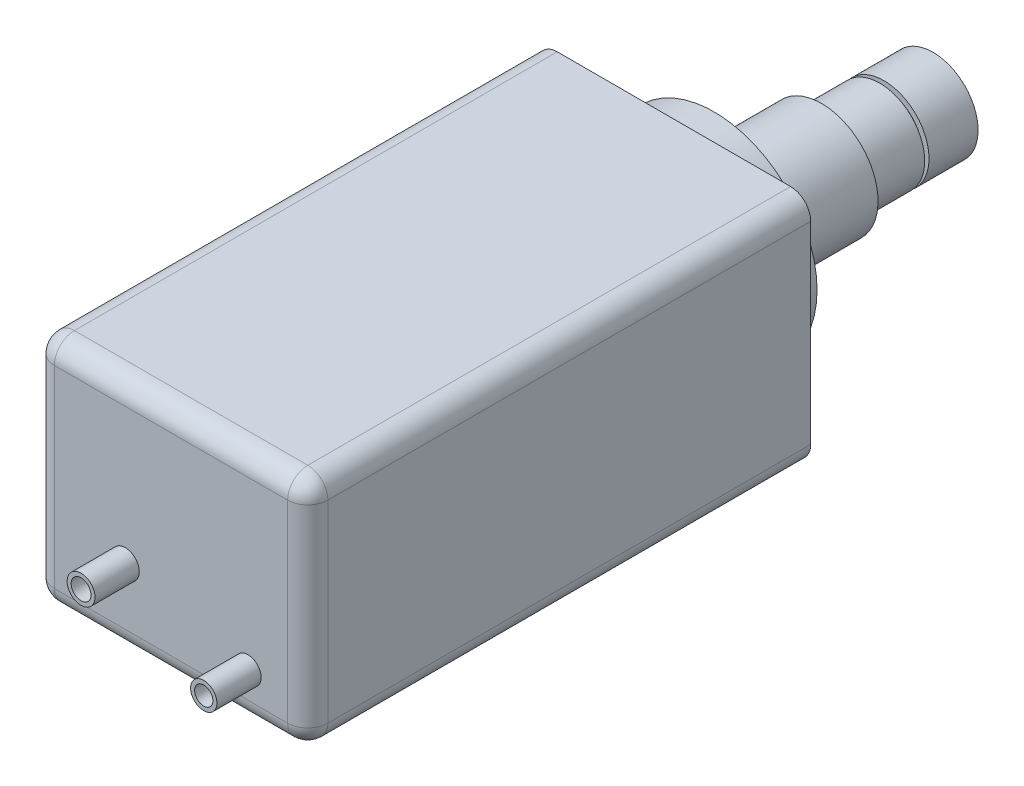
from build123d import *

# Parameters (mm, degrees)
ESQUISSE1_W             = 68
ESQUISSE1_H             = 58
BOSS_EXTRU_1_DEPTH      = 125
CONG_1_R                = 5
CONG_2_R                = 5
ESQUISSE2_R             = 25.575207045
BOSS_EXTRU_2_DEPTH      = 10
BOSS_EXTRU_3_DEPTH      = 13
BOSS_EXTRU_3_DRAFT      = 11
ESQUISSE5_R             = 2
ENL_V_MAT_EXTRU_1_DEPTH = 15
ESQUISSE6_R             = 3.467423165
ESQUISSE6_R_2           = 2.467423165
ESQUISSE6_R_3           = 3.271915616
ESQUISSE6_R_4           = 2.271915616
EXTRU_MINCE1_DEPTH      = 11


with BuildPart() as part:
    # Esquisse1 → Boss.-Extru.1 (new body)
    with BuildSketch(Plane.XY):
        Rectangle(ESQUISSE1_W, ESQUISSE1_H)
    extrude(amount=BOSS_EXTRU_1_DEPTH)

    # Cong_1
    cong_1_edges = [part.edges().sort_by_distance(p)[0] for p in [
        (-34, 29, 62.5),
        (34, 29, 62.5),
        (34, -29, 62.5),
        (-34, -29, 62.5),
    ]]
    fillet(cong_1_edges, radius=CONG_1_R)

    # Cong_2
    cong_2_edges = [part.edges().sort_by_distance(p)[0] for p in [
        (0, -29, 125),
        (-34, 0, 125),
        (34, 0, 125),
        (0, 29, 125),
        (32.535533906, 27.535533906, 125),
        (-32.535533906, 27.535533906, 125),
        (32.535533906, -27.535533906, 125),
        (-32.535533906, -27.535533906, 125),
    ]]
    fillet(cong_2_edges, radius=CONG_2_R)

    # Esquisse2 → Boss.-Extru.2 (add)
    with BuildSketch(Plane(origin=(0, 0, 0), x_dir=(-1, 0, 0), z_dir=(0, 0, -1))):
        with Locations(Location((0, 0, 0), (0, 0, 180))):
            Circle(ESQUISSE2_R)
    extrude(amount=BOSS_EXTRU_2_DEPTH)

    # Esquisse3 → R_volution1 (revolve)
    with BuildSketch(Plane(origin=(0, 0, 0), x_dir=(1, 0, 0), z_dir=(0, 1, 0))):
        Polygon((0, 10), (-14.039365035, 10), (-14.039365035, 36.694475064), (-11.19796355, 36.694475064), (-11.19796355, 51.134927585), (-9.754671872, 51.134927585), (-9.754671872, 52.198601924), (-11.19796355, 52.198601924), (-11.19796355, 64.396684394), (0, 64.396684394), align=None)
    revolve(axis=Axis((0, 0, -64.396684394), (0, 0, 1)))


with BuildPart() as boss_extru_3_tool:
    # Esquisse4 → Boss.-Extru.3 (with draft: the straight prism first)
    with BuildSketch(Plane.XZ.offset(29)):
        with BuildLine():
            Line((19.5, 0), (19.5, 35.585952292))
            ThreePointArc((19.5, 35.585952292), (0, 48), (-19.5, 35.585952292))
            Line((-19.5, 35.585952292), (-19.5, 0))
            Line((-19.5, 0), (19.5, 0))
        make_face()
    extrude(amount=BOSS_EXTRU_3_DEPTH)
    # Boss.-Extru.3: the draft: its side faces are tilted about the plane it starts from
    boss_extru_3_sides = [boss_extru_3_tool.faces().sort_by_distance(p)[0] for p in [
        (-19.5, -35.5, 17.792976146),
        (0, -35.5, 0),
        (19.5, -35.5, 17.792976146),
        (0, -35.5, 48),
    ]]
    draft(boss_extru_3_sides, Plane.XZ.offset(29), BOSS_EXTRU_3_DRAFT)


with BuildPart() as part_1:
    add(part.part)

    # Boss.-Extru.3: add boss_extru_3_tool
    add(boss_extru_3_tool.part)

    # Esquisse5 → Enl_v. mat.-Extru.1 (cut)
    with BuildSketch(Plane.XZ.offset(42)):
        with Locations(Location((0, 40, 0), (0, 0, 270))):
            Circle(ESQUISSE5_R)
        with Locations(Location((0, 22, 0), (0, 0, 270))):
            Circle(ESQUISSE5_R)
    extrude(amount=-ENL_V_MAT_EXTRU_1_DEPTH, mode=Mode.SUBTRACT)

    # Esquisse6 → Extru.-Mince1 (add)
    # profile 1 of 2: a face of its own
    with BuildSketch(Plane.XY.offset(125)):
        with Locations((-11.343326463, -9.857624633)):
            Circle(ESQUISSE6_R)
        with Locations((-11.343326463, -9.857624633)):
            Circle(ESQUISSE6_R_2, mode=Mode.SUBTRACT)
    # profile 2 of 2: a face of its own
    with BuildSketch(Plane.XY.offset(125)):
        with Locations((19.14753507, -17.480340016)):
            Circle(ESQUISSE6_R_3)
        with Locations((19.14753507, -17.480340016)):
            Circle(ESQUISSE6_R_4, mode=Mode.SUBTRACT)
    extrude(amount=EXTRU_MINCE1_DEPTH)


solid = part_1.part
